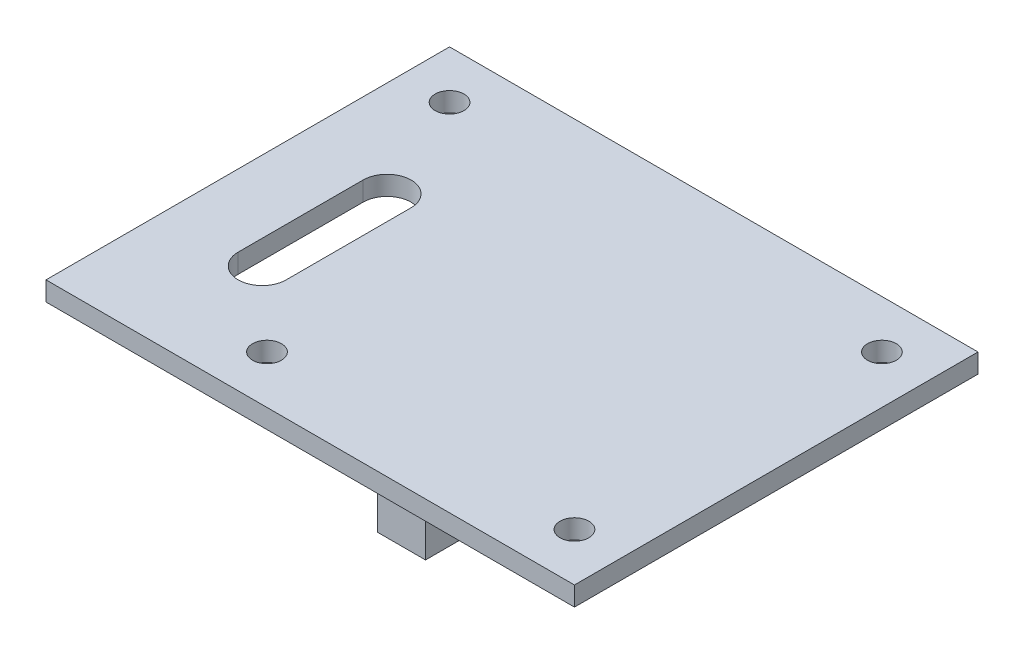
from build123d import *

# Parameters (mm, degrees)
SKICA1_W                 = 55
SKICA1_H                 = 42
SKICA1_R                 = 1.5
P_IDAT_VYSUNUT_M1_DEPTH  = 2
P_IDAT_START             = -2
SKICA12_W                = 5
SKICA12_H                = 5
P_IDAT_VYSUNUT_M5_DEPTH  = 12
SKICA13_R                = 1
ODEBRAT_VYSUNUT_M2_DEPTH = 6


with BuildPart() as part:
    # Skica1 → P_idat vysunut_m1 (new body)
    with BuildSketch(Plane(origin=(0, 0, 0), x_dir=(1, 0, 0), z_dir=(0, 1, 0))):
        with Locations((27.5, 21)):
            Rectangle(SKICA1_W, SKICA1_H)
        with Locations(Location((5, 37, 0), (0, 0, 270))):
            Circle(SKICA1_R, mode=Mode.SUBTRACT)
        with Locations(Location((18, 5, 0), (0, 0, 270))):
            Circle(SKICA1_R, mode=Mode.SUBTRACT)
        with Locations(Location((50, 5, 0), (0, 0, 270))):
            Circle(SKICA1_R, mode=Mode.SUBTRACT)
        with Locations(Location((50, 37, 0), (0, 0, 270))):
            Circle(SKICA1_R, mode=Mode.SUBTRACT)
        with BuildLine():
            Line((12.5, 25.5), (12.5, 12.5))
            ThreePointArc((12.5, 12.5), (10, 10), (7.5, 12.5))
            Line((7.5, 12.5), (7.5, 25.5))
            ThreePointArc((7.5, 25.5), (10, 28), (12.5, 25.5))
        make_face(mode=Mode.SUBTRACT)
    extrude(amount=P_IDAT_VYSUNUT_M1_DEPTH)

    # Skica12 → P_idat vysunut_m5 (add)
    with BuildSketch(Plane(origin=(0, 2, 0), x_dir=(1, 0, 0), z_dir=(0, 1, 0)).offset(P_IDAT_START)):
        with Locations((28.5, 11)):
            Rectangle(SKICA12_W, SKICA12_H)
        with Locations((28.5, 39.5)):
            Rectangle(SKICA12_W, SKICA12_H)
    extrude(amount=-P_IDAT_VYSUNUT_M5_DEPTH)

    # Skica13 → Odebrat vysunut_m2 (cut)
    with BuildSketch(Plane.ZY.offset(-26)):
        with Locations((-11, -6)):
            Circle(SKICA13_R)
        with Locations((-39.5, -6)):
            Circle(SKICA13_R)
    extrude(amount=-ODEBRAT_VYSUNUT_M2_DEPTH, mode=Mode.SUBTRACT)


solid = part.part
